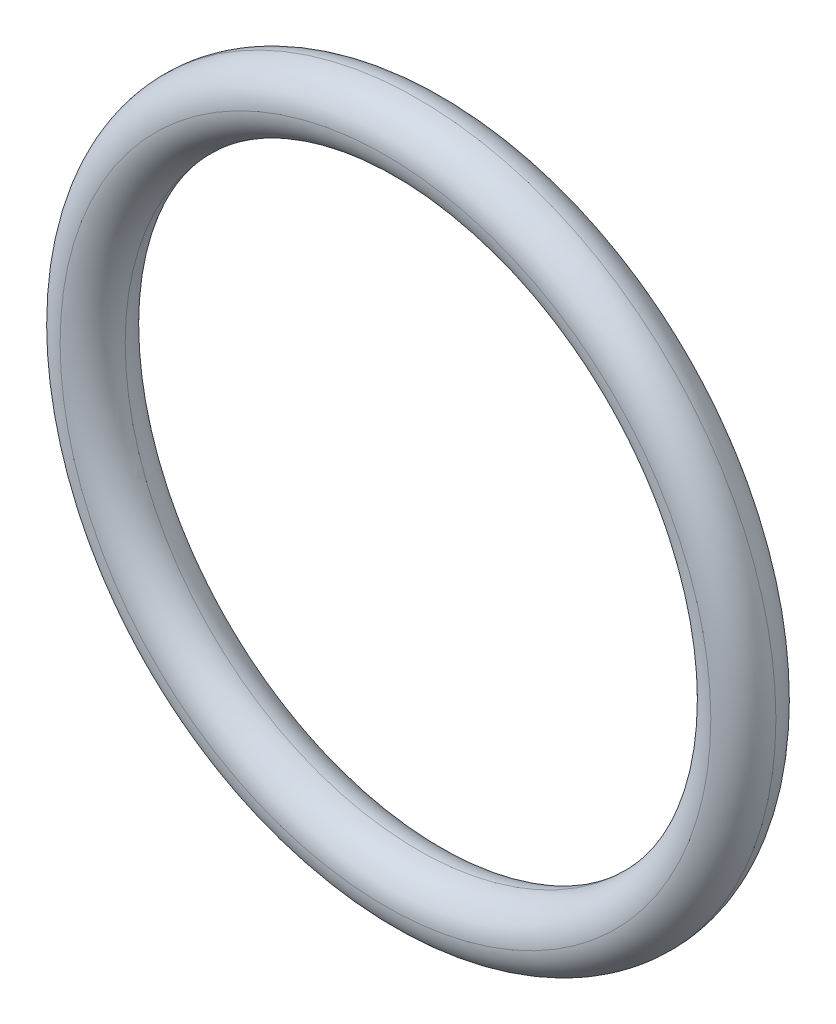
ISO-10303-21;
HEADER;
FILE_DESCRIPTION(('STEP AP214'),'2;1');
FILE_NAME('part.step','',(''),(''),'','','');
FILE_SCHEMA(('AUTOMOTIVE_DESIGN { 1 0 10303 214 1 1 1 1 }'));
ENDSEC;
DATA;
#1=APPLICATION_CONTEXT('core data for automotive mechanical design processes');
#2=APPLICATION_PROTOCOL_DEFINITION('international standard','automotive_design',2000,#1);
#3=PRODUCT_CONTEXT('',#1,'mechanical');
#4=PRODUCT('Part','Part','',(#3));
#5=PRODUCT_RELATED_PRODUCT_CATEGORY('part','',(#4));
#6=PRODUCT_DEFINITION_FORMATION('','',#4);
#7=PRODUCT_DEFINITION_CONTEXT('part definition',#1,'design');
#8=PRODUCT_DEFINITION('design','',#6,#7);
#9=PRODUCT_DEFINITION_SHAPE('','',#8);
#10=(LENGTH_UNIT() NAMED_UNIT(*) SI_UNIT(.MILLI.,.METRE.));
#11=(NAMED_UNIT(*) PLANE_ANGLE_UNIT() SI_UNIT($,.RADIAN.));
#12=(NAMED_UNIT(*) SI_UNIT($,.STERADIAN.) SOLID_ANGLE_UNIT());
#13=UNCERTAINTY_MEASURE_WITH_UNIT(LENGTH_MEASURE(1.E-05),#10,'distance_accuracy_value','');
#14=(GEOMETRIC_REPRESENTATION_CONTEXT(3) GLOBAL_UNCERTAINTY_ASSIGNED_CONTEXT((#13)) GLOBAL_UNIT_ASSIGNED_CONTEXT((#10,
#11,#12)) REPRESENTATION_CONTEXT('',''));
#15=CARTESIAN_POINT('',(0.,0.,0.));
#16=DIRECTION('',(0.,0.,1.));
#17=DIRECTION('',(1.,0.,0.));
#18=AXIS2_PLACEMENT_3D('',#15,#16,#17);
#19=CARTESIAN_POINT('',(0.,0.,4.));
#20=DIRECTION('',(0.,0.,1.));
#21=DIRECTION('',(1.,0.,0.));
#22=AXIS2_PLACEMENT_3D('',#19,#20,#21);
#23=TOROIDAL_SURFACE('',#22,40.,4.);
#24=CARTESIAN_POINT('',(0.,0.,4.));
#25=DIRECTION('',(0.,0.,1.));
#26=DIRECTION('',(1.,0.,0.));
#27=AXIS2_PLACEMENT_3D('',#24,#25,#26);
#28=CIRCLE('',#27,44.);
#29=CARTESIAN_POINT('',(44.,0.,4.));
#30=VERTEX_POINT('',#29);
#31=EDGE_CURVE('E34',#30,#30,#28,.F.);
#32=ORIENTED_EDGE('',*,*,#31,.F.);
#33=EDGE_LOOP('',(#32));
#34=FACE_BOUND('',#33,.T.);
#35=CARTESIAN_POINT('',(0.,0.,8.));
#36=DIRECTION('',(0.,0.,1.));
#37=DIRECTION('',(1.,0.,0.));
#38=AXIS2_PLACEMENT_3D('',#35,#36,#37);
#39=CIRCLE('',#38,40.);
#40=CARTESIAN_POINT('',(40.,0.,8.));
#41=VERTEX_POINT('',#40);
#42=EDGE_CURVE('E10',#41,#41,#39,.T.);
#43=ORIENTED_EDGE('',*,*,#42,.F.);
#44=EDGE_LOOP('',(#43));
#45=FACE_BOUND('',#44,.T.);
#46=ADVANCED_FACE('F28',(#34,#45),#23,.T.);
#47=CARTESIAN_POINT('',(0.,0.,4.));
#48=DIRECTION('',(0.,0.,1.));
#49=DIRECTION('',(1.,0.,0.));
#50=AXIS2_PLACEMENT_3D('',#47,#48,#49);
#51=TOROIDAL_SURFACE('',#50,40.,4.);
#52=ORIENTED_EDGE('',*,*,#42,.T.);
#53=EDGE_LOOP('',(#52));
#54=FACE_BOUND('',#53,.T.);
#55=CARTESIAN_POINT('',(0.,0.,4.));
#56=DIRECTION('',(0.,0.,1.));
#57=DIRECTION('',(1.,0.,0.));
#58=AXIS2_PLACEMENT_3D('',#55,#56,#57);
#59=CIRCLE('',#58,36.);
#60=CARTESIAN_POINT('',(36.,0.,4.));
#61=VERTEX_POINT('',#60);
#62=EDGE_CURVE('E38',#61,#61,#59,.T.);
#63=ORIENTED_EDGE('',*,*,#62,.F.);
#64=EDGE_LOOP('',(#63));
#65=FACE_BOUND('',#64,.T.);
#66=ADVANCED_FACE('F52',(#54,#65),#51,.T.);
#67=CARTESIAN_POINT('',(0.,0.,4.));
#68=DIRECTION('',(0.,0.,1.));
#69=DIRECTION('',(1.,0.,0.));
#70=AXIS2_PLACEMENT_3D('',#67,#68,#69);
#71=TOROIDAL_SURFACE('',#70,40.,4.);
#72=ORIENTED_EDGE('',*,*,#31,.T.);
#73=EDGE_LOOP('',(#72));
#74=FACE_BOUND('',#73,.T.);
#75=CARTESIAN_POINT('',(0.,0.,0.));
#76=DIRECTION('',(0.,0.,1.));
#77=DIRECTION('',(1.,0.,0.));
#78=AXIS2_PLACEMENT_3D('',#75,#76,#77);
#79=CIRCLE('',#78,40.);
#80=CARTESIAN_POINT('',(40.,0.,0.));
#81=VERTEX_POINT('',#80);
#82=EDGE_CURVE('E42',#81,#81,#79,.F.);
#83=ORIENTED_EDGE('',*,*,#82,.F.);
#84=EDGE_LOOP('',(#83));
#85=FACE_BOUND('',#84,.T.);
#86=ADVANCED_FACE('F50',(#74,#85),#71,.T.);
#87=CARTESIAN_POINT('',(0.,0.,4.));
#88=DIRECTION('',(0.,0.,1.));
#89=DIRECTION('',(1.,0.,0.));
#90=AXIS2_PLACEMENT_3D('',#87,#88,#89);
#91=TOROIDAL_SURFACE('',#90,40.,4.);
#92=ORIENTED_EDGE('',*,*,#62,.T.);
#93=EDGE_LOOP('',(#92));
#94=FACE_BOUND('',#93,.T.);
#95=ORIENTED_EDGE('',*,*,#82,.T.);
#96=EDGE_LOOP('',(#95));
#97=FACE_BOUND('',#96,.T.);
#98=ADVANCED_FACE('F48',(#94,#97),#91,.T.);
#99=CLOSED_SHELL('',(#46,#66,#86,#98));
#100=MANIFOLD_SOLID_BREP('B2',#99);
#101=ADVANCED_BREP_SHAPE_REPRESENTATION('',(#18,#100),#14);
#102=SHAPE_DEFINITION_REPRESENTATION(#9,#101);
ENDSEC;
END-ISO-10303-21;
